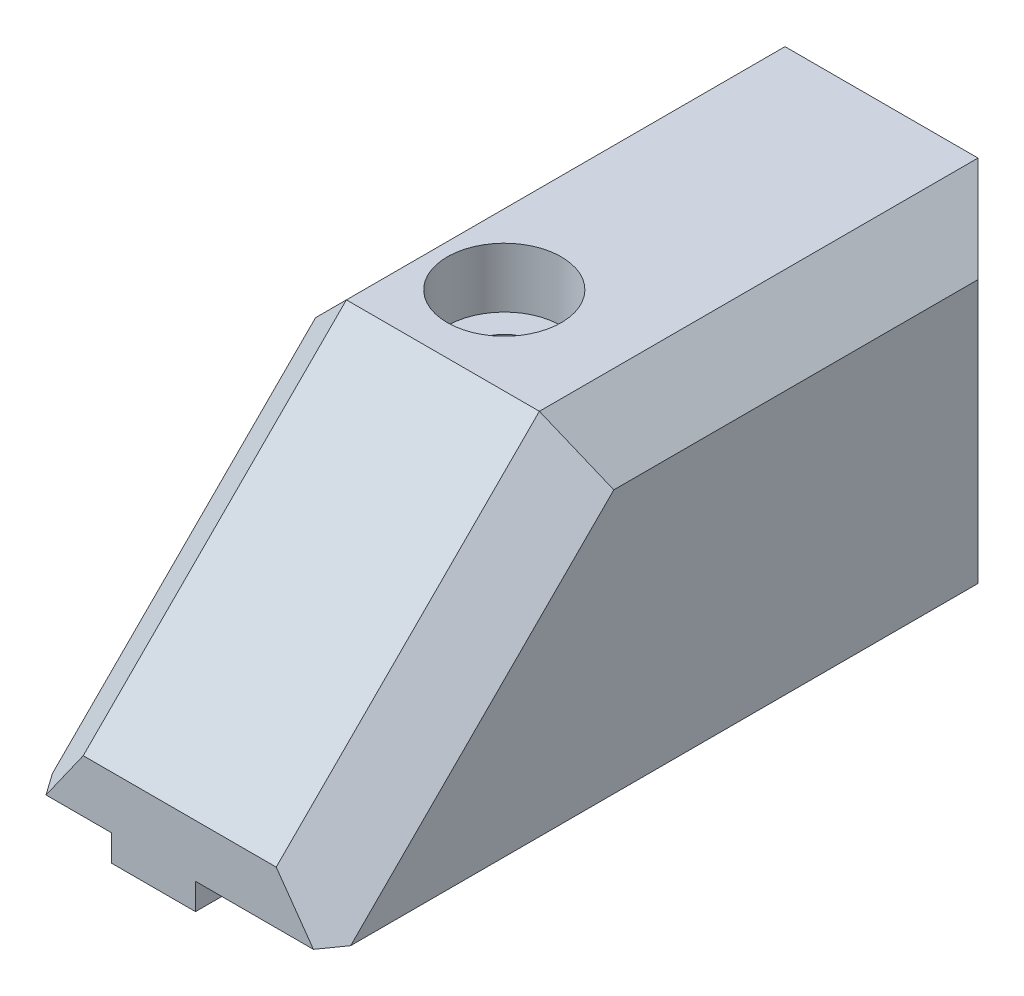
from build123d import *

# Parameters (mm, degrees)
SKIZZE1_W                                            = 17
SKIZZE1_H                                            = 40
AUFSATZ_LINEAR_AUSTRAGEN1_DEPTH                      = 18
SKIZZE2_W                                            = 4.8
SKIZZE2_H                                            = 40
AUFSATZ_LINEAR_AUSTRAGEN2_DEPTH                      = 1.5
STIRNSENKUNG_F_R_M3_ZYLINDERSCHRAUBE_MIT_D           = 3.4
STIRNSENKUNG_F_R_M3_ZYLINDERSCHRAUBE_MIT_CBORE_D     = 6.5
STIRNSENKUNG_F_R_M3_ZYLINDERSCHRAUBE_MIT_CBORE_DEPTH = 3.4
F_6_0_5_6_DURCHMESSER_BOHRUNG1_D                     = 5.6
F_6_0_5_6_DURCHMESSER_BOHRUNG1_DEPTH                 = 15
SCHNITT_LINEAR_AUSTRAGEN1_DEPTH                      = 32.827660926
FASE1_SIZE                                           = 3


with BuildPart() as part:
    # Skizze1 → Aufsatz-Linear austragen1 (new body)
    with BuildSketch(Plane(origin=(0, 0, 0), x_dir=(1, 0, 0), z_dir=(0, 1, 0))):
        Rectangle(SKIZZE1_W, SKIZZE1_H)
    extrude(amount=AUFSATZ_LINEAR_AUSTRAGEN1_DEPTH)

    # Skizze2 → Aufsatz-Linear austragen2 (add)
    with BuildSketch(Plane.XZ):
        with Locations((-1.5, 0)):
            Rectangle(SKIZZE2_W, SKIZZE2_H)
    extrude(amount=AUFSATZ_LINEAR_AUSTRAGEN2_DEPTH)

    # Stirnsenkung f_r M3 Zylinderschraube mit (through all)
    with Locations(Plane(origin=(0, 18, 0), x_dir=(1, 0, 0), z_dir=(0, 1, 0))):
        with Locations((-1.5, 0)):
            CounterBoreHole(STIRNSENKUNG_F_R_M3_ZYLINDERSCHRAUBE_MIT_D / 2, STIRNSENKUNG_F_R_M3_ZYLINDERSCHRAUBE_MIT_CBORE_D / 2, STIRNSENKUNG_F_R_M3_ZYLINDERSCHRAUBE_MIT_CBORE_DEPTH)

    # 6.0 _5.6_ Durchmesser Bohrung1
    with Locations(Plane(origin=(0, 0, -20), x_dir=(-1, 0, 0), z_dir=(0, 0, -1))):
        with Locations((1.5, 12)):
            Hole(F_6_0_5_6_DURCHMESSER_BOHRUNG1_D / 2, depth=F_6_0_5_6_DURCHMESSER_BOHRUNG1_DEPTH)

    # Skizze9 → Schnitt-Linear austragen1 (cut, through all)
    with BuildSketch(Plane(origin=(8.5, 0, 0), x_dir=(0, 0, -1), z_dir=(1, 0, 0))):
        Polygon((-20, 3), (-5, 18), (-20, 18), align=None)
    extrude(amount=-SCHNITT_LINEAR_AUSTRAGEN1_DEPTH, mode=Mode.SUBTRACT)

    # Fase1
    fase1_edges = [part.edges().sort_by_distance(p)[0] for p in [
        (-8.5, 9, -20),
        (-8.5, 10.5, 12.5),
        (-8.5, 18, -7.5),
        (8.5, 9, -20),
        (8.5, 10.5, 12.5),
        (8.5, 18, -7.5),
    ]]
    chamfer(fase1_edges, length=FASE1_SIZE)


solid = part.part
